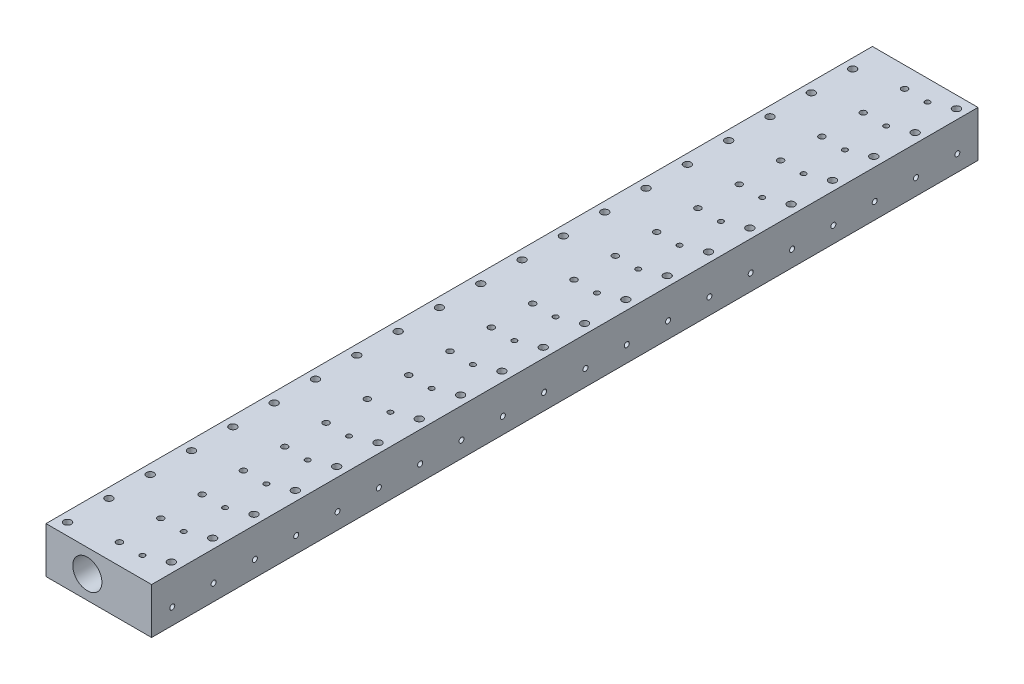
from build123d import *

# Parameters (mm, degrees)
SKETCH1_W                      = 23
SKETCH1_H                      = 10
BOSS_EXTRUDE1_DEPTH            = 180
SKETCH5_R                      = 3.175
CUT_EXTRUDE1_DEPTH             = 181.43627684
M2X0_4_TAPPED_HOLE1_AT_2_COUNT = 2
M2X0_4_TAPPED_HOLE1_AT_2_PITCH = 19.180198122
LPATTERN1_COUNT                = 20
LPATTERN1_PITCH                = 9


with BuildPart() as part:
    # Sketch1 → Boss-Extrude1 (new body)
    with BuildSketch(Plane.XY):
        Rectangle(SKETCH1_W, SKETCH1_H)
    extrude(amount=-BOSS_EXTRUDE1_DEPTH)

    # Sketch4 → 55 _0.052_ Diameter Hole1 (revolve, cut)
    with BuildSketch(Plane(origin=(0, 5, -4.5), x_dir=(0, 0, 1), z_dir=(1, 0, 0))):
        Polygon((0, 0), (0, 7.396808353), (0.6604, 7), (0.6604, 0), align=None)
    f_55_0_052_diameter_hole1 = revolve(axis=Axis((0, 11.35, -4.5), (0, -1, 0)), mode=Mode.SUBTRACT)

    # Sketch5 → Cut-Extrude1 (cut, through all)
    with BuildSketch(Plane.XY):
        with Locations((-2.5, 0)):
            Circle(SKETCH5_R)
    extrude(amount=-CUT_EXTRUDE1_DEPTH, mode=Mode.SUBTRACT)

    # Sketch8 → M2x0.4 Tapped Hole1 (revolve, cut)
    with BuildSketch(Plane(origin=(9.4, 5, -6.4), x_dir=(0, 0, 1), z_dir=(1, 0, 0))):
        Polygon((0, 0), (0, 5.680688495), (0.8, 5.2), (0.8, 0), align=None)
    m2x0_4_tapped_hole1 = revolve(axis=Axis((9.4, 11.35, -6.4), (0, -1, 0)), mode=Mode.SUBTRACT)

    # M2x0.4 Tapped Hole1 at 2: M2x0.4 Tapped Hole1 ×2
    with Locations(*[Vector(-0.9801775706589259, 0, 0.1981209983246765) * (i * M2X0_4_TAPPED_HOLE1_AT_2_PITCH) for i in range(1, M2X0_4_TAPPED_HOLE1_AT_2_COUNT)]):
        add(m2x0_4_tapped_hole1, mode=Mode.SUBTRACT)

    # Sketch12 → 57 _0.043_ Diameter Hole1 (revolve, cut)
    with BuildSketch(Plane(origin=(11.5, -1.5, -4.5), x_dir=(0, 0, -1), z_dir=(0, 1, 0))):
        Polygon((0, 0), (0, 6.328129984), (0.5461, 6), (0.5461, 0), align=None)
    f_57_0_043_diameter_hole1 = revolve(axis=Axis((17.85, -1.5, -4.5), (-1, 0, 0)), mode=Mode.SUBTRACT)

    # Sketch14 → 57 _0.043_ Diameter Hole2 (revolve, cut)
    with BuildSketch(Plane(origin=(5, 5, -4.5), x_dir=(0, 0, 1), z_dir=(1, 0, 0))):
        Polygon((0, 0), (0, 7.828129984), (0.5461, 7.5), (0.5461, 0), align=None)
    f_57_0_043_diameter_hole2 = revolve(axis=Axis((5, 11.35, -4.5), (0, -1, 0)), mode=Mode.SUBTRACT)

    # LPattern1: 55 _0.052_ Diameter Hole1, M2x0.4 Tapped Hole1, 57 _0.043_ Diameter Hole1, 57 _0.043_ Diameter Hole2 ×20
    with Locations(*[(0, 0, -i * LPATTERN1_PITCH) for i in range(1, LPATTERN1_COUNT)]):
        add(f_55_0_052_diameter_hole1, mode=Mode.SUBTRACT)
        add(m2x0_4_tapped_hole1, mode=Mode.SUBTRACT)
        add(f_57_0_043_diameter_hole1, mode=Mode.SUBTRACT)
        add(f_57_0_043_diameter_hole2, mode=Mode.SUBTRACT)

    # LPattern1 copy 1 sketch → LPattern1 copy 1 (revolve, cut)
    with BuildSketch(Plane(origin=(-9.4, 5, -11.6), x_dir=(0, 0, 1), z_dir=(1, 0, 0))):
        Polygon((0, 0), (0, 5.680688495), (0.8, 5.2), (0.8, 0), align=None)
    revolve(axis=Axis((-9.4, 11.35, -11.6), (0, -1, 0)), mode=Mode.SUBTRACT)

    # LPattern1 copy 2 sketch → LPattern1 copy 2 (revolve, cut)
    with BuildSketch(Plane(origin=(-9.4, 5, -20.6), x_dir=(0, 0, 1), z_dir=(1, 0, 0))):
        Polygon((0, 0), (0, 5.680688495), (0.8, 5.2), (0.8, 0), align=None)
    revolve(axis=Axis((-9.4, 11.35, -20.6), (0, -1, 0)), mode=Mode.SUBTRACT)

    # LPattern1 copy 3 sketch → LPattern1 copy 3 (revolve, cut)
    with BuildSketch(Plane(origin=(-9.4, 5, -29.6), x_dir=(0, 0, 1), z_dir=(1, 0, 0))):
        Polygon((0, 0), (0, 5.680688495), (0.8, 5.2), (0.8, 0), align=None)
    revolve(axis=Axis((-9.4, 11.35, -29.6), (0, -1, 0)), mode=Mode.SUBTRACT)

    # LPattern1 copy 4 sketch → LPattern1 copy 4 (revolve, cut)
    with BuildSketch(Plane(origin=(-9.4, 5, -38.6), x_dir=(0, 0, 1), z_dir=(1, 0, 0))):
        Polygon((0, 0), (0, 5.680688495), (0.8, 5.2), (0.8, 0), align=None)
    revolve(axis=Axis((-9.4, 11.35, -38.6), (0, -1, 0)), mode=Mode.SUBTRACT)

    # LPattern1 copy 5 sketch → LPattern1 copy 5 (revolve, cut)
    with BuildSketch(Plane(origin=(-9.4, 5, -47.6), x_dir=(0, 0, 1), z_dir=(1, 0, 0))):
        Polygon((0, 0), (0, 5.680688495), (0.8, 5.2), (0.8, 0), align=None)
    revolve(axis=Axis((-9.4, 11.35, -47.6), (0, -1, 0)), mode=Mode.SUBTRACT)

    # LPattern1 copy 6 sketch → LPattern1 copy 6 (revolve, cut)
    with BuildSketch(Plane(origin=(-9.4, 5, -56.6), x_dir=(0, 0, 1), z_dir=(1, 0, 0))):
        Polygon((0, 0), (0, 5.680688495), (0.8, 5.2), (0.8, 0), align=None)
    revolve(axis=Axis((-9.4, 11.35, -56.6), (0, -1, 0)), mode=Mode.SUBTRACT)

    # LPattern1 copy 7 sketch → LPattern1 copy 7 (revolve, cut)
    with BuildSketch(Plane(origin=(-9.4, 5, -65.6), x_dir=(0, 0, 1), z_dir=(1, 0, 0))):
        Polygon((0, 0), (0, 5.680688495), (0.8, 5.2), (0.8, 0), align=None)
    revolve(axis=Axis((-9.4, 11.35, -65.6), (0, -1, 0)), mode=Mode.SUBTRACT)

    # LPattern1 copy 8 sketch → LPattern1 copy 8 (revolve, cut)
    with BuildSketch(Plane(origin=(-9.4, 5, -74.6), x_dir=(0, 0, 1), z_dir=(1, 0, 0))):
        Polygon((0, 0), (0, 5.680688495), (0.8, 5.2), (0.8, 0), align=None)
    revolve(axis=Axis((-9.4, 11.35, -74.6), (0, -1, 0)), mode=Mode.SUBTRACT)

    # LPattern1 copy 9 sketch → LPattern1 copy 9 (revolve, cut)
    with BuildSketch(Plane(origin=(-9.4, 5, -83.6), x_dir=(0, 0, 1), z_dir=(1, 0, 0))):
        Polygon((0, 0), (0, 5.680688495), (0.8, 5.2), (0.8, 0), align=None)
    revolve(axis=Axis((-9.4, 11.35, -83.6), (0, -1, 0)), mode=Mode.SUBTRACT)

    # LPattern1 copy 10 sketch → LPattern1 copy 10 (revolve, cut)
    with BuildSketch(Plane(origin=(-9.4, 5, -92.6), x_dir=(0, 0, 1), z_dir=(1, 0, 0))):
        Polygon((0, 0), (0, 5.680688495), (0.8, 5.2), (0.8, 0), align=None)
    revolve(axis=Axis((-9.4, 11.35, -92.6), (0, -1, 0)), mode=Mode.SUBTRACT)

    # LPattern1 copy 11 sketch → LPattern1 copy 11 (revolve, cut)
    with BuildSketch(Plane(origin=(-9.4, 5, -101.6), x_dir=(0, 0, 1), z_dir=(1, 0, 0))):
        Polygon((0, 0), (0, 5.680688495), (0.8, 5.2), (0.8, 0), align=None)
    revolve(axis=Axis((-9.4, 11.35, -101.6), (0, -1, 0)), mode=Mode.SUBTRACT)

    # LPattern1 copy 12 sketch → LPattern1 copy 12 (revolve, cut)
    with BuildSketch(Plane(origin=(-9.4, 5, -110.6), x_dir=(0, 0, 1), z_dir=(1, 0, 0))):
        Polygon((0, 0), (0, 5.680688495), (0.8, 5.2), (0.8, 0), align=None)
    revolve(axis=Axis((-9.4, 11.35, -110.6), (0, -1, 0)), mode=Mode.SUBTRACT)

    # LPattern1 copy 13 sketch → LPattern1 copy 13 (revolve, cut)
    with BuildSketch(Plane(origin=(-9.4, 5, -119.6), x_dir=(0, 0, 1), z_dir=(1, 0, 0))):
        Polygon((0, 0), (0, 5.680688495), (0.8, 5.2), (0.8, 0), align=None)
    revolve(axis=Axis((-9.4, 11.35, -119.6), (0, -1, 0)), mode=Mode.SUBTRACT)

    # LPattern1 copy 14 sketch → LPattern1 copy 14 (revolve, cut)
    with BuildSketch(Plane(origin=(-9.4, 5, -128.6), x_dir=(0, 0, 1), z_dir=(1, 0, 0))):
        Polygon((0, 0), (0, 5.680688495), (0.8, 5.2), (0.8, 0), align=None)
    revolve(axis=Axis((-9.4, 11.35, -128.6), (0, -1, 0)), mode=Mode.SUBTRACT)

    # LPattern1 copy 15 sketch → LPattern1 copy 15 (revolve, cut)
    with BuildSketch(Plane(origin=(-9.4, 5, -137.6), x_dir=(0, 0, 1), z_dir=(1, 0, 0))):
        Polygon((0, 0), (0, 5.680688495), (0.8, 5.2), (0.8, 0), align=None)
    revolve(axis=Axis((-9.4, 11.35, -137.6), (0, -1, 0)), mode=Mode.SUBTRACT)

    # LPattern1 copy 16 sketch → LPattern1 copy 16 (revolve, cut)
    with BuildSketch(Plane(origin=(-9.4, 5, -146.6), x_dir=(0, 0, 1), z_dir=(1, 0, 0))):
        Polygon((0, 0), (0, 5.680688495), (0.8, 5.2), (0.8, 0), align=None)
    revolve(axis=Axis((-9.4, 11.35, -146.6), (0, -1, 0)), mode=Mode.SUBTRACT)

    # LPattern1 copy 17 sketch → LPattern1 copy 17 (revolve, cut)
    with BuildSketch(Plane(origin=(-9.4, 5, -155.6), x_dir=(0, 0, 1), z_dir=(1, 0, 0))):
        Polygon((0, 0), (0, 5.680688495), (0.8, 5.2), (0.8, 0), align=None)
    revolve(axis=Axis((-9.4, 11.35, -155.6), (0, -1, 0)), mode=Mode.SUBTRACT)

    # LPattern1 copy 18 sketch → LPattern1 copy 18 (revolve, cut)
    with BuildSketch(Plane(origin=(-9.4, 5, -164.6), x_dir=(0, 0, 1), z_dir=(1, 0, 0))):
        Polygon((0, 0), (0, 5.680688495), (0.8, 5.2), (0.8, 0), align=None)
    revolve(axis=Axis((-9.4, 11.35, -164.6), (0, -1, 0)), mode=Mode.SUBTRACT)

    # LPattern1 copy 19 sketch → LPattern1 copy 19 (revolve, cut)
    with BuildSketch(Plane(origin=(-9.4, 5, -173.6), x_dir=(0, 0, 1), z_dir=(1, 0, 0))):
        Polygon((0, 0), (0, 5.680688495), (0.8, 5.2), (0.8, 0), align=None)
    revolve(axis=Axis((-9.4, 11.35, -173.6), (0, -1, 0)), mode=Mode.SUBTRACT)


solid = part.part
